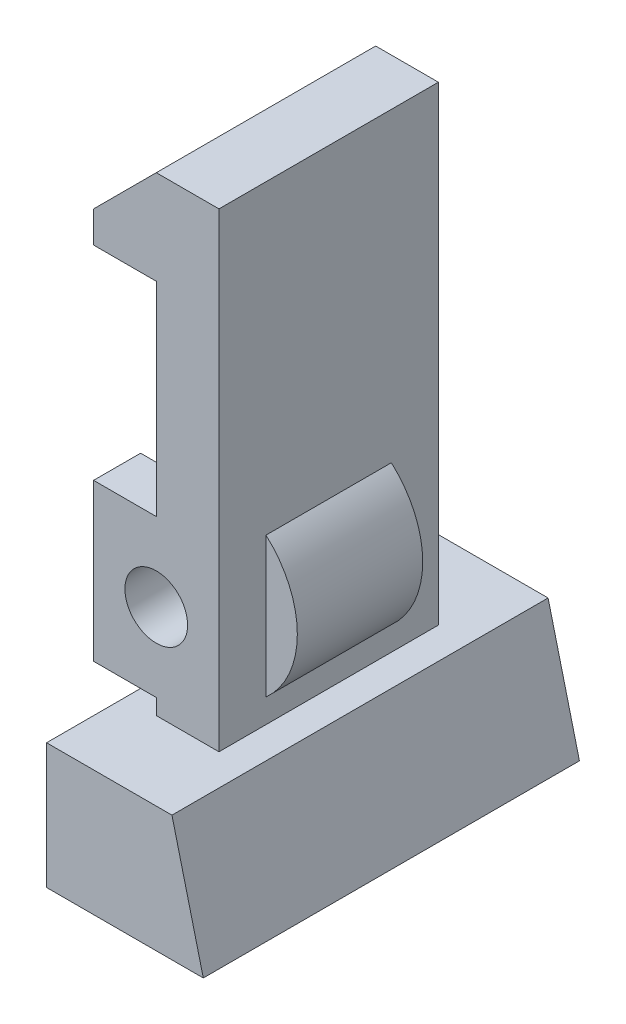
from build123d import *

# Parameters (mm, degrees)
CLIP_DEPTH          = 3.5
TALON_DEPTH         = 6
BOSSE_ARRI_RE_DEPTH = 2
ESQUISSE5_W         = 2
ESQUISSE5_H         = 5
BUT_E_AVANT_DEPTH   = 1.5
TROU_AXE_DEPTH      = 15
TROU_AXE_DEPTH_BACK = 15
ESQUISSE6_R         = 1


with BuildPart() as part:
    # Esquisse2 → Clip (new, symmetric)
    with BuildSketch(Plane.XY):
        Polygon((0, 0), (0, 9), (-2, 9), (-2, 10), (0, 12), (2, 12), (2, -3), (0, -3), align=None)
    extrude(amount=CLIP_DEPTH, both=True)

    # Esquisse3 → Talon (add, symmetric)
    with BuildSketch(Plane.XY):
        Polygon((2, -3), (3, -3), (4, -7), (-1, -7), (-1, -3), (0, -3), align=None)
    extrude(amount=TALON_DEPTH, both=True)

    # Esquisse4 → Bosse arri_re (add, symmetric)
    with BuildSketch(Plane.XY):
        with BuildLine():
            Line((0, 3), (0, -3))
            ThreePointArc((0, -3), (3, 0), (0, 3))
        make_face()
    extrude(amount=BOSSE_ARRI_RE_DEPTH, both=True)

    # Esquisse5 → But_e avant (add)
    with BuildSketch(Plane.XY.offset(3.5)):
        with Locations((-1, 0)):
            Rectangle(ESQUISSE5_W, ESQUISSE5_H)
    but_e_avant = extrude(amount=-BUT_E_AVANT_DEPTH)

    # Sym_trie1: But_e avant across plane
    add(but_e_avant.mirror(Plane.XY))

    # Esquisse6 → Trou axe (cut, two sides: drawn at the far end of the back side and taken through both)
    with BuildSketch(Plane.XY.offset(-TROU_AXE_DEPTH_BACK)):
        with Locations(Location((0, 0, 0), (0, 0, 180))):
            Circle(ESQUISSE6_R)
    extrude(amount=TROU_AXE_DEPTH + TROU_AXE_DEPTH_BACK, mode=Mode.SUBTRACT)


solid = part.part
